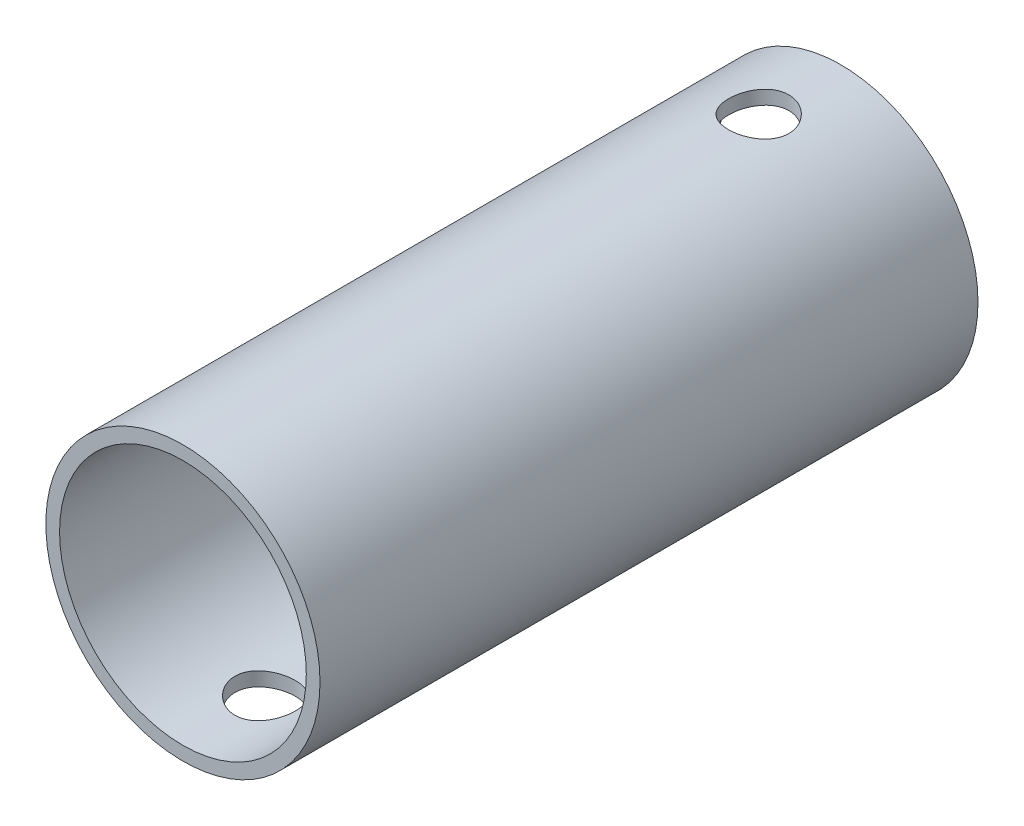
from build123d import *

# Parameters (mm, degrees)
SKETCH1_R           = 250
SKETCH1_R_2         = 225
BOSS_EXTRUDE1_DEPTH = 1200
SKETCH4_R           = 55
CUT_EXTRUDE1_DEPTH  = 1200
SKETCH5_R           = 55
CUT_EXTRUDE2_DEPTH  = 1200


with BuildPart() as part:
    # Sketch1 → Boss-Extrude1 (new body)
    with BuildSketch(Plane.XY):
        Circle(SKETCH1_R)
        Circle(SKETCH1_R_2, mode=Mode.SUBTRACT)
    extrude(amount=BOSS_EXTRUDE1_DEPTH)

    # Sketch4 → Cut-Extrude1 (cut)
    with BuildSketch(Plane(origin=(0, 0, 0), x_dir=(1, 0, 0), z_dir=(0, 1, 0))):
        with Locations(Location((0, -150, 0), (0, 0, 90))):
            Circle(SKETCH4_R)
    extrude(amount=CUT_EXTRUDE1_DEPTH, mode=Mode.SUBTRACT)

    # Sketch5 → Cut-Extrude2 (cut)
    with BuildSketch(Plane(origin=(0, 0, 0), x_dir=(1, 0, 0), z_dir=(0, 1, 0))):
        with Locations(Location((0, -1050, 0), (0, 0, 270))):
            Circle(SKETCH5_R)
    extrude(amount=-CUT_EXTRUDE2_DEPTH, mode=Mode.SUBTRACT)


solid = part.part
